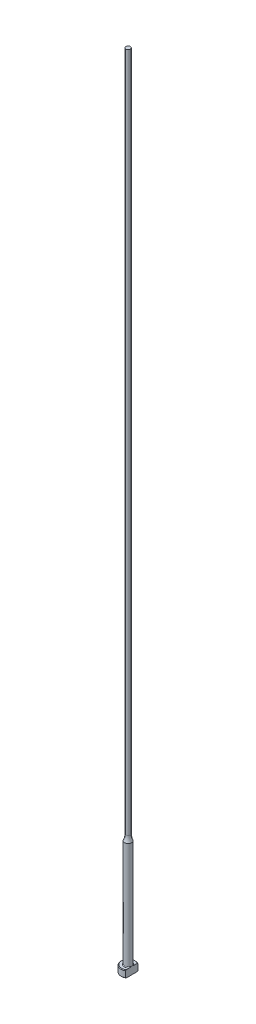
ISO-10303-21;
HEADER;
FILE_DESCRIPTION(('STEP AP214'),'2;1');
FILE_NAME('part.step','',(''),(''),'','','');
FILE_SCHEMA(('AUTOMOTIVE_DESIGN { 1 0 10303 214 1 1 1 1 }'));
ENDSEC;
DATA;
#1=APPLICATION_CONTEXT('core data for automotive mechanical design processes');
#2=APPLICATION_PROTOCOL_DEFINITION('international standard','automotive_design',2000,#1);
#3=PRODUCT_CONTEXT('',#1,'mechanical');
#4=PRODUCT('Part','Part','',(#3));
#5=PRODUCT_RELATED_PRODUCT_CATEGORY('part','',(#4));
#6=PRODUCT_DEFINITION_FORMATION('','',#4);
#7=PRODUCT_DEFINITION_CONTEXT('part definition',#1,'design');
#8=PRODUCT_DEFINITION('design','',#6,#7);
#9=PRODUCT_DEFINITION_SHAPE('','',#8);
#10=(LENGTH_UNIT() NAMED_UNIT(*) SI_UNIT(.MILLI.,.METRE.));
#11=(NAMED_UNIT(*) PLANE_ANGLE_UNIT() SI_UNIT($,.RADIAN.));
#12=(NAMED_UNIT(*) SI_UNIT($,.STERADIAN.) SOLID_ANGLE_UNIT());
#13=UNCERTAINTY_MEASURE_WITH_UNIT(LENGTH_MEASURE(1.E-05),#10,'distance_accuracy_value','');
#14=(GEOMETRIC_REPRESENTATION_CONTEXT(3) GLOBAL_UNCERTAINTY_ASSIGNED_CONTEXT((#13)) GLOBAL_UNIT_ASSIGNED_CONTEXT((#10,
#11,#12)) REPRESENTATION_CONTEXT('',''));
#15=CARTESIAN_POINT('',(0.,0.,0.));
#16=DIRECTION('',(0.,0.,1.));
#17=DIRECTION('',(1.,0.,0.));
#18=AXIS2_PLACEMENT_3D('',#15,#16,#17);
#19=CARTESIAN_POINT('',(-3.17499999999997,3.175,0.));
#20=DIRECTION('',(0.,1.,0.));
#21=DIRECTION('',(0.,0.,1.));
#22=AXIS2_PLACEMENT_3D('',#19,#20,#21);
#23=PLANE('',#22);
#24=CARTESIAN_POINT('',(0.,3.175,0.));
#25=DIRECTION('',(0.,1.,0.));
#26=DIRECTION('',(0.,0.,1.));
#27=AXIS2_PLACEMENT_3D('',#24,#25,#26);
#28=CIRCLE('',#27,2.92099999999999);
#29=CARTESIAN_POINT('',(1.58749999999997,3.175,-2.4519552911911));
#30=VERTEX_POINT('',#29);
#31=CARTESIAN_POINT('',(1.58749999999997,3.175,2.4519552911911));
#32=VERTEX_POINT('',#31);
#33=EDGE_CURVE('E105',#30,#32,#28,.T.);
#34=ORIENTED_EDGE('',*,*,#33,.T.);
#35=DIRECTION('',(0.,0.,1.));
#36=VECTOR('',#35,1.);
#37=CARTESIAN_POINT('',(1.58749999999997,3.17499999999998,2.74963065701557));
#38=LINE('',#37,#36);
#39=CARTESIAN_POINT('',(1.58749999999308,3.175,0.933255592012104));
#40=VERTEX_POINT('',#39);
#41=EDGE_CURVE('E126',#40,#32,#38,.T.);
#42=ORIENTED_EDGE('',*,*,#41,.F.);
#43=CARTESIAN_POINT('',(0.,3.175,0.));
#44=DIRECTION('',(0.,1.,0.));
#45=DIRECTION('',(0.,0.,1.));
#46=AXIS2_PLACEMENT_3D('',#43,#44,#45);
#47=CIRCLE('',#46,1.84149999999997);
#48=CARTESIAN_POINT('',(1.58749999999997,3.17500000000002,-0.933255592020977));
#49=VERTEX_POINT('',#48);
#50=EDGE_CURVE('E11',#40,#49,#47,.F.);
#51=ORIENTED_EDGE('',*,*,#50,.T.);
#52=EDGE_CURVE('E52',#30,#49,#38,.T.);
#53=ORIENTED_EDGE('',*,*,#52,.F.);
#54=EDGE_LOOP('',(#34,#42,#51,#53));
#55=FACE_BOUND('',#54,.T.);
#56=ADVANCED_FACE('F32',(#55),#23,.T.);
#57=CARTESIAN_POINT('',(0.,259.958771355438,0.));
#58=DIRECTION('',(0.,1.,0.));
#59=DIRECTION('',(0.,0.,1.));
#60=AXIS2_PLACEMENT_3D('',#57,#58,#59);
#61=CYLINDRICAL_SURFACE('',#60,3.17499999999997);
#62=CARTESIAN_POINT('',(0.,2.92100000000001,0.));
#63=DIRECTION('',(0.,1.,0.));
#64=DIRECTION('',(0.,0.,1.));
#65=AXIS2_PLACEMENT_3D('',#62,#63,#64);
#66=CIRCLE('',#65,3.17499999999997);
#67=CARTESIAN_POINT('',(1.58749999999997,2.92100000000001,2.74963065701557));
#68=VERTEX_POINT('',#67);
#69=CARTESIAN_POINT('',(1.58749999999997,2.92100000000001,-2.74963065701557));
#70=VERTEX_POINT('',#69);
#71=EDGE_CURVE('E98',#68,#70,#66,.F.);
#72=ORIENTED_EDGE('',*,*,#71,.T.);
#73=DIRECTION('',(0.,-1.,0.));
#74=VECTOR('',#73,1.);
#75=CARTESIAN_POINT('',(1.58749999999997,355.601,-2.74963065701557));
#76=LINE('',#75,#74);
#77=CARTESIAN_POINT('',(1.58749999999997,0.253999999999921,-2.74963065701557));
#78=VERTEX_POINT('',#77);
#79=EDGE_CURVE('E141',#70,#78,#76,.T.);
#80=ORIENTED_EDGE('',*,*,#79,.T.);
#81=CARTESIAN_POINT('',(0.,0.253999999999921,0.));
#82=DIRECTION('',(0.,-1.,0.));
#83=DIRECTION('',(0.,0.,-1.));
#84=AXIS2_PLACEMENT_3D('',#81,#82,#83);
#85=CIRCLE('',#84,3.17499999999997);
#86=CARTESIAN_POINT('',(1.58749999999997,0.253999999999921,2.74963065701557));
#87=VERTEX_POINT('',#86);
#88=EDGE_CURVE('E95',#78,#87,#85,.F.);
#89=ORIENTED_EDGE('',*,*,#88,.T.);
#90=DIRECTION('',(0.,-1.,0.));
#91=VECTOR('',#90,1.);
#92=CARTESIAN_POINT('',(1.58749999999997,355.601,2.74963065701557));
#93=LINE('',#92,#91);
#94=EDGE_CURVE('E88',#68,#87,#93,.T.);
#95=ORIENTED_EDGE('',*,*,#94,.F.);
#96=EDGE_LOOP('',(#72,#80,#89,#95));
#97=FACE_BOUND('',#96,.T.);
#98=ADVANCED_FACE('F191',(#97),#61,.T.);
#99=CARTESIAN_POINT('',(0.,0.,0.));
#100=DIRECTION('',(0.,-1.,0.));
#101=DIRECTION('',(0.,0.,-1.));
#102=AXIS2_PLACEMENT_3D('',#99,#100,#101);
#103=PLANE('',#102);
#104=CARTESIAN_POINT('',(0.,0.,0.));
#105=DIRECTION('',(0.,-1.,0.));
#106=DIRECTION('',(0.,0.,-1.));
#107=AXIS2_PLACEMENT_3D('',#104,#105,#106);
#108=CIRCLE('',#107,2.92100000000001);
#109=CARTESIAN_POINT('',(1.58749999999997,0.,2.45195529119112));
#110=VERTEX_POINT('',#109);
#111=CARTESIAN_POINT('',(1.58749999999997,0.,-2.45195529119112));
#112=VERTEX_POINT('',#111);
#113=EDGE_CURVE('E93',#110,#112,#108,.T.);
#114=ORIENTED_EDGE('',*,*,#113,.T.);
#115=DIRECTION('',(0.,0.,1.));
#116=VECTOR('',#115,1.);
#117=CARTESIAN_POINT('',(1.58749999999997,0.,2.74963065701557));
#118=LINE('',#117,#116);
#119=EDGE_CURVE('E78',#112,#110,#118,.T.);
#120=ORIENTED_EDGE('',*,*,#119,.T.);
#121=EDGE_LOOP('',(#114,#120));
#122=FACE_BOUND('',#121,.T.);
#123=ADVANCED_FACE('F97',(#122),#103,.T.);
#124=CARTESIAN_POINT('',(0.,3.17499999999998,0.));
#125=DIRECTION('',(0.,-1.,0.));
#126=DIRECTION('',(0.,0.,-1.));
#127=AXIS2_PLACEMENT_3D('',#124,#125,#126);
#128=CONICAL_SURFACE('',#127,2.92100000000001,0.785398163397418);
#129=ORIENTED_EDGE('',*,*,#71,.F.);
#130=CARTESIAN_POINT('',(1.58749999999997,-0.161620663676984,-6.0529050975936));
#131=CARTESIAN_POINT('',(1.58749999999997,-0.0288893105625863,-5.91567682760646));
#132=CARTESIAN_POINT('',(1.58749999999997,0.103699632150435,-5.77831035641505));
#133=CARTESIAN_POINT('',(1.58749999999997,0.368508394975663,-5.50321874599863));
#134=CARTESIAN_POINT('',(1.58749999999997,0.5007282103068,-5.3654936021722));
#135=CARTESIAN_POINT('',(1.58749999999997,0.764778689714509,-5.08953516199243));
#136=CARTESIAN_POINT('',(1.58749999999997,0.896609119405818,-4.95130164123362));
#137=CARTESIAN_POINT('',(1.58749999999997,1.15968706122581,-4.67428233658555));
#138=CARTESIAN_POINT('',(1.58749999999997,1.29093457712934,-4.5354965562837));
#139=CARTESIAN_POINT('',(1.58749999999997,1.55007705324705,-4.25997724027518));
#140=CARTESIAN_POINT('',(1.58749999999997,1.67798684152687,-4.12325766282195));
#141=CARTESIAN_POINT('',(1.58749999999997,1.9328486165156,-3.84892898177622));
#142=CARTESIAN_POINT('',(1.58749999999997,2.05980060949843,-3.71131988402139));
#143=CARTESIAN_POINT('',(1.58749999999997,2.31237508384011,-3.43493978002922));
#144=CARTESIAN_POINT('',(1.58749999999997,2.43799784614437,-3.29616903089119));
#145=CARTESIAN_POINT('',(1.58749999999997,2.68741369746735,-3.01699558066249));
#146=CARTESIAN_POINT('',(1.58749999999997,2.81120686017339,-2.8765929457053));
#147=CARTESIAN_POINT('',(1.58749999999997,3.00875865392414,-2.64816703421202));
#148=CARTESIAN_POINT('',(1.58749999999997,3.08336151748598,-2.56087478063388));
#149=CARTESIAN_POINT('',(1.58749999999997,3.23123871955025,-2.385154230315));
#150=CARTESIAN_POINT('',(1.58749999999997,3.30451292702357,-2.29672582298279));
#151=CARTESIAN_POINT('',(1.58749999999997,3.45004422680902,-2.11747400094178));
#152=CARTESIAN_POINT('',(1.58749999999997,3.52228237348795,-2.02663514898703));
#153=CARTESIAN_POINT('',(1.58749999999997,3.66423097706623,-1.84302524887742));
#154=CARTESIAN_POINT('',(1.58749999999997,3.73394203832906,-1.75025467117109));
#155=CARTESIAN_POINT('',(1.58749999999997,3.87080633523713,-1.56067475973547));
#156=CARTESIAN_POINT('',(1.58749999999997,3.93790459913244,-1.46382547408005));
#157=CARTESIAN_POINT('',(1.58749999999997,4.06669147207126,-1.26632594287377));
#158=CARTESIAN_POINT('',(1.58749999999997,4.12837264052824,-1.16567073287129));
#159=CARTESIAN_POINT('',(1.58749999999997,4.21402252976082,-1.01165766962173));
#160=CARTESIAN_POINT('',(1.58749999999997,4.2412792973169,-0.960142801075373));
#161=CARTESIAN_POINT('',(1.58749999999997,4.29309798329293,-0.85578092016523));
#162=CARTESIAN_POINT('',(1.58749999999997,4.3176594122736,-0.802933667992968));
#163=CARTESIAN_POINT('',(1.58749999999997,4.38614656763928,-0.642461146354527));
#164=CARTESIAN_POINT('',(1.58749999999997,4.42510149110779,-0.532518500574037));
#165=CARTESIAN_POINT('',(1.58749999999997,4.46726244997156,-0.367680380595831));
#166=CARTESIAN_POINT('',(1.58749999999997,4.47844427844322,-0.314802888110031));
#167=CARTESIAN_POINT('',(1.58749999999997,4.49576654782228,-0.208209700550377));
#168=CARTESIAN_POINT('',(1.58749999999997,4.50190743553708,-0.154494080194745));
#169=CARTESIAN_POINT('',(1.58749999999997,4.50871296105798,-0.0468792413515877));
#170=CARTESIAN_POINT('',(1.58749999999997,4.50939451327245,0.00701889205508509));
#171=CARTESIAN_POINT('',(1.58749999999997,4.5052767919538,0.114606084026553));
#172=CARTESIAN_POINT('',(1.58749999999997,4.5004770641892,0.16829512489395));
#173=CARTESIAN_POINT('',(1.58749999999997,4.48579689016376,0.274485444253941));
#174=CARTESIAN_POINT('',(1.58749999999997,4.47596081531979,0.326992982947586));
#175=CARTESIAN_POINT('',(1.58749999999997,4.4518180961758,0.430974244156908));
#176=CARTESIAN_POINT('',(1.58749999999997,4.43750969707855,0.482447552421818));
#177=CARTESIAN_POINT('',(1.58749999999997,4.40502489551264,0.58446088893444));
#178=CARTESIAN_POINT('',(1.58749999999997,4.38682724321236,0.634994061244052));
#179=CARTESIAN_POINT('',(1.58749999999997,4.34729308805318,0.734789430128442));
#180=CARTESIAN_POINT('',(1.58749999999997,4.32595722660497,0.784051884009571));
#181=CARTESIAN_POINT('',(1.58749999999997,4.25791922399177,0.93054934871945));
#182=CARTESIAN_POINT('',(1.58749999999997,4.20736047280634,1.02598802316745));
#183=CARTESIAN_POINT('',(1.58749999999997,4.09955451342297,1.21304313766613));
#184=CARTESIAN_POINT('',(1.58749999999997,4.04229912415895,1.30465471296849));
#185=CARTESIAN_POINT('',(1.58749999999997,3.92308746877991,1.48526211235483));
#186=CARTESIAN_POINT('',(1.58749999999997,3.86111349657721,1.57424615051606));
#187=CARTESIAN_POINT('',(1.58749999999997,3.73408621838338,1.74990003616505));
#188=CARTESIAN_POINT('',(1.58749999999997,3.66903444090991,1.83657099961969));
#189=CARTESIAN_POINT('',(1.58749999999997,3.53583371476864,2.009317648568));
#190=CARTESIAN_POINT('',(1.58749999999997,3.46765527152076,2.09537048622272));
#191=CARTESIAN_POINT('',(1.58749999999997,3.32960643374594,2.26611736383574));
#192=CARTESIAN_POINT('',(1.58749999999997,3.25973586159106,2.35081125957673));
#193=CARTESIAN_POINT('',(1.58749999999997,3.04858139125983,2.60290121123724));
#194=CARTESIAN_POINT('',(1.58749999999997,2.90542388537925,2.7687253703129));
#195=CARTESIAN_POINT('',(1.58749999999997,2.64069522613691,3.06970913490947));
#196=CARTESIAN_POINT('',(1.58749999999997,2.5195945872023,3.20528660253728));
#197=CARTESIAN_POINT('',(1.58749999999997,2.27590400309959,3.47510321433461));
#198=CARTESIAN_POINT('',(1.58749999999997,2.1533140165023,3.60934232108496));
#199=CARTESIAN_POINT('',(1.58749999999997,1.9069423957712,3.87695374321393));
#200=CARTESIAN_POINT('',(1.58749999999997,1.78315974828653,4.01032512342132));
#201=CARTESIAN_POINT('',(1.58749999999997,1.53478104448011,4.2763088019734));
#202=CARTESIAN_POINT('',(1.58749999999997,1.41018498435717,4.40892109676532));
#203=CARTESIAN_POINT('',(1.58749999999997,1.04574684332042,4.79499418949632));
#204=CARTESIAN_POINT('',(1.58749999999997,0.805076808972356,5.04767313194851));
#205=CARTESIAN_POINT('',(1.58749999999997,0.44312150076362,5.42550911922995));
#206=CARTESIAN_POINT('',(1.58749999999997,0.322378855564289,5.55118772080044));
#207=CARTESIAN_POINT('',(1.58749999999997,0.0805914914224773,5.8022520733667));
#208=CARTESIAN_POINT('',(1.58749999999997,-0.0404532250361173,5.92763782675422));
#209=CARTESIAN_POINT('',(1.58749999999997,-0.161620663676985,6.0529050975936));
#210=B_SPLINE_CURVE_WITH_KNOTS('',3,(#130,#131,#132,#133,#134,#135,#136,#137,#138,#139,#140,
#141,#142,#143,#144,#145,#146,#147,#148,#149,#150,#151,#152,#153,#154,#155,#156,#157,#158,#159,
#160,#161,#162,#163,#164,#165,#166,#167,#168,#169,#170,#171,#172,#173,#174,#175,#176,#177,#178,
#179,#180,#181,#182,#183,#184,#185,#186,#187,#188,#189,#190,#191,#192,#193,#194,#195,#196,#197,
#198,#199,#200,#201,#202,#203,#204,#205,#206,#207,#208,#209),.UNSPECIFIED.,.F.,.F.,(4,2,2,2,2,2,
2,2,2,2,2,2,2,2,2,2,2,2,2,2,2,2,2,2,2,2,2,2,2,2,2,2,2,2,2,2,2,2,2,4),(0.,0.572750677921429,
1.14550874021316,1.71856057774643,2.29160869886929,2.85328006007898,3.41494773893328,
3.97649423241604,4.53801804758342,4.88249307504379,5.2270018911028,5.57515326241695,
5.92322081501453,6.27657800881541,6.63041319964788,6.80518126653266,6.97998101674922,
7.32824262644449,7.49018491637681,7.65211285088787,7.81353889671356,7.97497832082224,
8.13501929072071,8.29512313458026,8.45612518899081,8.61709438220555,8.94062993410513,
9.26456495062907,9.58978187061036,9.91483894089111,10.2441741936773,10.5735441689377,
11.2306812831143,11.7760337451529,12.3214014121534,12.8672825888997,13.4131663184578,
14.4600164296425,14.9828595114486,15.505698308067),.UNSPECIFIED.);
#211=EDGE_CURVE('E118',#32,#68,#210,.T.);
#212=ORIENTED_EDGE('',*,*,#211,.F.);
#213=ORIENTED_EDGE('',*,*,#33,.F.);
#214=EDGE_CURVE('E117',#70,#30,#210,.T.);
#215=ORIENTED_EDGE('',*,*,#214,.F.);
#216=EDGE_LOOP('',(#129,#212,#213,#215));
#217=FACE_BOUND('',#216,.T.);
#218=ADVANCED_FACE('F162',(#217),#128,.T.);
#219=CARTESIAN_POINT('',(0.,0.253999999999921,0.));
#220=DIRECTION('',(0.,1.,0.));
#221=DIRECTION('',(0.,0.,1.));
#222=AXIS2_PLACEMENT_3D('',#219,#220,#221);
#223=CONICAL_SURFACE('',#222,3.17499999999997,0.785398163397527);
#224=ORIENTED_EDGE('',*,*,#88,.F.);
#225=CARTESIAN_POINT('',(1.58749999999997,3.33662066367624,6.0529050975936));
#226=CARTESIAN_POINT('',(1.58749999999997,3.20388931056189,5.91567682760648));
#227=CARTESIAN_POINT('',(1.58749999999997,3.07130036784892,5.7783103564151));
#228=CARTESIAN_POINT('',(1.58749999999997,2.80649160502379,5.50321874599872));
#229=CARTESIAN_POINT('',(1.58749999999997,2.6742717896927,5.36549360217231));
#230=CARTESIAN_POINT('',(1.58749999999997,2.41022131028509,5.08953516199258));
#231=CARTESIAN_POINT('',(1.58749999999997,2.27839088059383,4.95130164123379));
#232=CARTESIAN_POINT('',(1.58749999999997,2.01531293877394,4.67428233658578));
#233=CARTESIAN_POINT('',(1.58749999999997,1.88406542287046,4.53549655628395));
#234=CARTESIAN_POINT('',(1.58749999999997,1.62492294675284,4.25997724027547));
#235=CARTESIAN_POINT('',(1.58749999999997,1.49701315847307,4.12325766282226));
#236=CARTESIAN_POINT('',(1.58749999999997,1.24215138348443,3.84892898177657));
#237=CARTESIAN_POINT('',(1.58749999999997,1.11519939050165,3.71131988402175));
#238=CARTESIAN_POINT('',(1.58749999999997,0.862624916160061,3.43493978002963));
#239=CARTESIAN_POINT('',(1.58749999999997,0.737002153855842,3.29616903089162));
#240=CARTESIAN_POINT('',(1.58749999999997,0.487586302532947,3.01699558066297));
#241=CARTESIAN_POINT('',(1.58749999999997,0.363793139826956,2.8765929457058));
#242=CARTESIAN_POINT('',(1.58749999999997,0.166241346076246,2.64816703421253));
#243=CARTESIAN_POINT('',(1.58749999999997,0.0916384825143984,2.56087478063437));
#244=CARTESIAN_POINT('',(1.58749999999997,-0.0562387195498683,2.38515423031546));
#245=CARTESIAN_POINT('',(1.58749999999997,-0.129512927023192,2.29672582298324));
#246=CARTESIAN_POINT('',(1.58749999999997,-0.275044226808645,2.1174740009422));
#247=CARTESIAN_POINT('',(1.58749999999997,-0.347282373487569,2.02663514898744));
#248=CARTESIAN_POINT('',(1.58749999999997,-0.489230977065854,1.8430252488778));
#249=CARTESIAN_POINT('',(1.58749999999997,-0.558942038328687,1.75025467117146));
#250=CARTESIAN_POINT('',(1.58749999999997,-0.695806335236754,1.5606747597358));
#251=CARTESIAN_POINT('',(1.58749999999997,-0.762904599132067,1.46382547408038));
#252=CARTESIAN_POINT('',(1.58749999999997,-0.89169147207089,1.26632594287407));
#253=CARTESIAN_POINT('',(1.58749999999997,-0.953372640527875,1.16567073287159));
#254=CARTESIAN_POINT('',(1.58749999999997,-1.03902252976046,1.01165766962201));
#255=CARTESIAN_POINT('',(1.58749999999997,-1.06627929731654,0.960142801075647));
#256=CARTESIAN_POINT('',(1.58749999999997,-1.11809798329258,0.855780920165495));
#257=CARTESIAN_POINT('',(1.58749999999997,-1.14265941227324,0.802933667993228));
#258=CARTESIAN_POINT('',(1.58749999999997,-1.21114656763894,0.642461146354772));
#259=CARTESIAN_POINT('',(1.58749999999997,-1.25010149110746,0.532518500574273));
#260=CARTESIAN_POINT('',(1.58749999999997,-1.29226244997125,0.367680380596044));
#261=CARTESIAN_POINT('',(1.58749999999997,-1.30344427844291,0.314802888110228));
#262=CARTESIAN_POINT('',(1.58749999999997,-1.32076654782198,0.208209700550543));
#263=CARTESIAN_POINT('',(1.58749999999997,-1.32690743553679,0.154494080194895));
#264=CARTESIAN_POINT('',(1.58749999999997,-1.3337129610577,0.0468792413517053));
#265=CARTESIAN_POINT('',(1.58749999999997,-1.33439451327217,-0.00701889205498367));
#266=CARTESIAN_POINT('',(1.58749999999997,-1.33027679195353,-0.114606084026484));
#267=CARTESIAN_POINT('',(1.58749999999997,-1.32547706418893,-0.168295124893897));
#268=CARTESIAN_POINT('',(1.58749999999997,-1.31079689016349,-0.274485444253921));
#269=CARTESIAN_POINT('',(1.58749999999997,-1.30096081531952,-0.326992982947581));
#270=CARTESIAN_POINT('',(1.58749999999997,-1.27681809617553,-0.430974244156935));
#271=CARTESIAN_POINT('',(1.58749999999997,-1.26250969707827,-0.48244755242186));
#272=CARTESIAN_POINT('',(1.58749999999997,-1.23002489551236,-0.584460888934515));
#273=CARTESIAN_POINT('',(1.58749999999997,-1.21182724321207,-0.634994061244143));
#274=CARTESIAN_POINT('',(1.58749999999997,-1.17229308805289,-0.734789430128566));
#275=CARTESIAN_POINT('',(1.58749999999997,-1.15095722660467,-0.784051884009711));
#276=CARTESIAN_POINT('',(1.58749999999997,-1.08291922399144,-0.930549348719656));
#277=CARTESIAN_POINT('',(1.58749999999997,-1.03236047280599,-1.0259880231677));
#278=CARTESIAN_POINT('',(1.58749999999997,-0.924554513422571,-1.21304313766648));
#279=CARTESIAN_POINT('',(1.58749999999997,-0.867299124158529,-1.30465471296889));
#280=CARTESIAN_POINT('',(1.58749999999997,-0.748087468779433,-1.48526211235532));
#281=CARTESIAN_POINT('',(1.58749999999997,-0.686113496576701,-1.5742461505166));
#282=CARTESIAN_POINT('',(1.58749999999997,-0.559086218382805,-1.74990003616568));
#283=CARTESIAN_POINT('',(1.58749999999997,-0.494034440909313,-1.83657099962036));
#284=CARTESIAN_POINT('',(1.58749999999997,-0.360833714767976,-2.00931764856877));
#285=CARTESIAN_POINT('',(1.58749999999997,-0.292655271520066,-2.09537048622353));
#286=CARTESIAN_POINT('',(1.58749999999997,-0.154606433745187,-2.26611736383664));
#287=CARTESIAN_POINT('',(1.58749999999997,-0.0847358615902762,-2.35081125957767));
#288=CARTESIAN_POINT('',(1.58749999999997,0.126418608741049,-2.60290121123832));
#289=CARTESIAN_POINT('',(1.58749999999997,0.269576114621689,-2.76872537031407));
#290=CARTESIAN_POINT('',(1.58749999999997,0.534304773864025,-3.06970913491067));
#291=CARTESIAN_POINT('',(1.58749999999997,0.655405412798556,-3.20528660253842));
#292=CARTESIAN_POINT('',(1.58749999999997,0.899095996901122,-3.47510321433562));
#293=CARTESIAN_POINT('',(1.58749999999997,1.02168598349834,-3.60934232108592));
#294=CARTESIAN_POINT('',(1.58749999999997,1.26805760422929,-3.87695374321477));
#295=CARTESIAN_POINT('',(1.58749999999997,1.39184025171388,-4.0103251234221));
#296=CARTESIAN_POINT('',(1.58749999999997,1.64021895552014,-4.27630880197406));
#297=CARTESIAN_POINT('',(1.58749999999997,1.76481501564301,-4.40892109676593));
#298=CARTESIAN_POINT('',(1.58749999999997,2.12925315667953,-4.79499418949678));
#299=CARTESIAN_POINT('',(1.58749999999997,2.36992319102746,-5.04767313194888));
#300=CARTESIAN_POINT('',(1.58749999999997,2.73187849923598,-5.42550911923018));
#301=CARTESIAN_POINT('',(1.58749999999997,2.85262114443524,-5.55118772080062));
#302=CARTESIAN_POINT('',(1.58749999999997,3.09440850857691,-5.80225207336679));
#303=CARTESIAN_POINT('',(1.58749999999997,3.21545322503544,-5.92763782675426));
#304=CARTESIAN_POINT('',(1.58749999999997,3.33662066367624,-6.0529050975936));
#305=B_SPLINE_CURVE_WITH_KNOTS('',3,(#225,#226,#227,#228,#229,#230,#231,#232,#233,#234,#235,
#236,#237,#238,#239,#240,#241,#242,#243,#244,#245,#246,#247,#248,#249,#250,#251,#252,#253,#254,
#255,#256,#257,#258,#259,#260,#261,#262,#263,#264,#265,#266,#267,#268,#269,#270,#271,#272,#273,
#274,#275,#276,#277,#278,#279,#280,#281,#282,#283,#284,#285,#286,#287,#288,#289,#290,#291,#292,
#293,#294,#295,#296,#297,#298,#299,#300,#301,#302,#303,#304),.UNSPECIFIED.,.F.,.F.,(4,2,2,2,2,2,
2,2,2,2,2,2,2,2,2,2,2,2,2,2,2,2,2,2,2,2,2,2,2,2,2,2,2,2,2,2,2,2,2,4),(0.,0.572750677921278,
1.14550874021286,1.71856057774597,2.29160869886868,2.85328006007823,3.4149477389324,
3.97649423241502,4.53801804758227,4.88249307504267,5.22700189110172,5.5751532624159,
5.92322081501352,6.27657800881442,6.63041319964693,6.80518126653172,6.9799810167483,
7.3282426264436,7.49018491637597,7.65211285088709,7.81353889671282,7.97497832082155,
8.13501929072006,8.29512313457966,8.45612518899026,8.61709438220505,8.9406299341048,
9.2645649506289,9.58978187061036,9.91483894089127,10.2441741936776,10.5735441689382,
11.2306812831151,11.7760337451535,12.3214014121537,12.8672825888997,13.4131663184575,
14.4600164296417,14.9828595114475,15.5056983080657),.UNSPECIFIED.);
#306=EDGE_CURVE('E81',#112,#78,#305,.T.);
#307=ORIENTED_EDGE('',*,*,#306,.F.);
#308=ORIENTED_EDGE('',*,*,#113,.F.);
#309=EDGE_CURVE('E84',#87,#110,#305,.T.);
#310=ORIENTED_EDGE('',*,*,#309,.F.);
#311=EDGE_LOOP('',(#224,#307,#308,#310));
#312=FACE_BOUND('',#311,.T.);
#313=ADVANCED_FACE('F92',(#312),#223,.T.);
#314=CARTESIAN_POINT('',(0.,3.42900000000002,0.));
#315=DIRECTION('',(0.,1.,0.));
#316=DIRECTION('',(0.,0.,1.));
#317=AXIS2_PLACEMENT_3D('',#314,#315,#316);
#318=TOROIDAL_SURFACE('',#317,1.84149999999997,0.254);
#319=CARTESIAN_POINT('',(1.58749999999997,3.42900000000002,0.));
#320=CARTESIAN_POINT('',(1.58749999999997,3.42899942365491,-1.9220514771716E-10));
#321=CARTESIAN_POINT('',(1.58749999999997,3.42899884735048,-1.2261161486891E-07));
#322=CARTESIAN_POINT('',(1.58749999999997,3.42899773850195,-5.09676365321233E-07));
#323=CARTESIAN_POINT('',(1.58749999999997,3.42899720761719,-7.78176328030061E-07));
#324=CARTESIAN_POINT('',(1.58749999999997,3.42899614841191,-1.42307272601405E-06));
#325=CARTESIAN_POINT('',(1.58749999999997,3.42899562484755,-1.80713867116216E-06));
#326=CARTESIAN_POINT('',(1.58749999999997,3.42899463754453,-2.63494846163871E-06));
#327=CARTESIAN_POINT('',(1.58749999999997,3.42899417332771,-3.07814756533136E-06));
#328=CARTESIAN_POINT('',(1.58749999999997,3.42899261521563,-4.66897357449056E-06));
#329=CARTESIAN_POINT('',(1.58749999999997,3.42899159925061,-5.89404908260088E-06));
#330=CARTESIAN_POINT('',(1.58749999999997,3.42898979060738,-8.42427511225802E-06));
#331=CARTESIAN_POINT('',(1.58749999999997,3.42898899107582,-9.7248057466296E-06));
#332=CARTESIAN_POINT('',(1.58749999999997,3.42898598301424,-1.48060601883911E-05));
#333=CARTESIAN_POINT('',(1.58749999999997,3.42898393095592,-1.86838281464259E-05));
#334=CARTESIAN_POINT('',(1.58749999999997,3.42898057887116,-2.63261117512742E-05));
#335=CARTESIAN_POINT('',(1.58749999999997,3.42897922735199,-3.00687417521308E-05));
#336=CARTESIAN_POINT('',(1.58749999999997,3.42897347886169,-4.60276298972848E-05));
#337=CARTESIAN_POINT('',(1.58749999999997,3.42896911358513,-5.8247019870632E-05));
#338=CARTESIAN_POINT('',(1.58749999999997,3.42896211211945,-8.11070097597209E-05));
#339=CARTESIAN_POINT('',(1.58749999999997,3.42895931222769,-9.16953114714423E-05));
#340=CARTESIAN_POINT('',(1.58749999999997,3.42893712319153,-0.000168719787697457));
#341=CARTESIAN_POINT('',(1.58749999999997,3.42890881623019,-0.000232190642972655));
#342=CARTESIAN_POINT('',(1.58749999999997,3.42880276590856,-0.000479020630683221));
#343=CARTESIAN_POINT('',(1.58749999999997,3.42873165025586,-0.00066443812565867));
#344=CARTESIAN_POINT('',(1.58749999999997,3.42845137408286,-0.0013844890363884));
#345=CARTESIAN_POINT('',(1.58749999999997,3.42823526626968,-0.00191701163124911));
#346=CARTESIAN_POINT('',(1.58749999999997,3.42735449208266,-0.00409774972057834));
#347=CARTESIAN_POINT('',(1.58749999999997,3.42669768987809,-0.00574830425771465));
#348=CARTESIAN_POINT('',(1.58749999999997,3.4174405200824,-0.0289985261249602));
#349=CARTESIAN_POINT('',(1.58749999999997,3.40878325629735,-0.0505816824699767));
#350=CARTESIAN_POINT('',(1.58749999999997,3.39189297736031,-0.0929947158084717));
#351=CARTESIAN_POINT('',(1.58749999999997,3.38365605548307,-0.11382315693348));
#352=CARTESIAN_POINT('',(1.58749999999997,3.36635393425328,-0.157956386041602));
#353=CARTESIAN_POINT('',(1.58749999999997,3.35730391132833,-0.181267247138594));
#354=CARTESIAN_POINT('',(1.58749999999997,3.33936775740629,-0.228222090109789));
#355=CARTESIAN_POINT('',(1.58749999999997,3.33048420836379,-0.25186705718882));
#356=CARTESIAN_POINT('',(1.58749999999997,3.30894496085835,-0.310512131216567));
#357=CARTESIAN_POINT('',(1.58749999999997,3.29649449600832,-0.345588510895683));
#358=CARTESIAN_POINT('',(1.58749999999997,3.27296975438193,-0.415278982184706));
#359=CARTESIAN_POINT('',(1.58749999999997,3.26186987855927,-0.449884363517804));
#360=CARTESIAN_POINT('',(1.58749999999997,3.2395832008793,-0.524471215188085));
#361=CARTESIAN_POINT('',(1.58749999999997,3.22860862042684,-0.564517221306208));
#362=CARTESIAN_POINT('',(1.58749999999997,3.20902534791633,-0.645529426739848));
#363=CARTESIAN_POINT('',(1.58749999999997,3.20043582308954,-0.686500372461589));
#364=CARTESIAN_POINT('',(1.58749999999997,3.18611712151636,-0.771546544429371));
#365=CARTESIAN_POINT('',(1.58749999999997,3.18059550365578,-0.815658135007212));
#366=CARTESIAN_POINT('',(1.58749999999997,3.17455396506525,-0.904117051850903));
#367=CARTESIAN_POINT('',(1.58749999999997,3.17401361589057,-0.948462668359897));
#368=CARTESIAN_POINT('',(1.58749999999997,3.17898948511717,-1.02531896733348));
#369=CARTESIAN_POINT('',(1.58749999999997,3.1829739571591,-1.05792141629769));
#370=CARTESIAN_POINT('',(1.58749999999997,3.19569167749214,-1.12184393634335));
#371=CARTESIAN_POINT('',(1.58749999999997,3.20436049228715,-1.1531753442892));
#372=CARTESIAN_POINT('',(1.58749999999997,3.22236152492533,-1.19946468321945));
#373=CARTESIAN_POINT('',(1.58749999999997,3.2295150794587,-1.21526783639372));
#374=CARTESIAN_POINT('',(1.58749999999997,3.24587062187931,-1.24583726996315));
#375=CARTESIAN_POINT('',(1.58749999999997,3.25507530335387,-1.26060215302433));
#376=CARTESIAN_POINT('',(1.58749999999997,3.27378481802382,-1.28575815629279));
#377=CARTESIAN_POINT('',(1.58749999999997,3.28289001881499,-1.29644383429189));
#378=CARTESIAN_POINT('',(1.58749999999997,3.30268460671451,-1.31623154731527));
#379=CARTESIAN_POINT('',(1.58749999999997,3.31337067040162,-1.32533681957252));
#380=CARTESIAN_POINT('',(1.58749999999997,3.33349977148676,-1.33941140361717));
#381=CARTESIAN_POINT('',(1.58749999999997,3.34261446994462,-1.34484814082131));
#382=CARTESIAN_POINT('',(1.58749999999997,3.36161455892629,-1.35416329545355));
#383=CARTESIAN_POINT('',(1.58749999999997,3.37149946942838,-1.35804267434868));
#384=CARTESIAN_POINT('',(1.58749999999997,3.39188678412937,-1.36398436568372));
#385=CARTESIAN_POINT('',(1.58749999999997,3.40239309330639,-1.36603350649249));
#386=CARTESIAN_POINT('',(1.58749999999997,3.42360372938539,-1.3680840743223));
#387=CARTESIAN_POINT('',(1.58749999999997,3.43430795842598,-1.36808648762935));
#388=CARTESIAN_POINT('',(1.58749999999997,3.45433283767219,-1.36616208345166));
#389=CARTESIAN_POINT('',(1.58749999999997,3.46367506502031,-1.36444960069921));
#390=CARTESIAN_POINT('',(1.58749999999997,3.48195519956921,-1.35953338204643));
#391=CARTESIAN_POINT('',(1.58749999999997,3.49089304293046,-1.3563294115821));
#392=CARTESIAN_POINT('',(1.58749999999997,3.50850302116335,-1.34848006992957));
#393=CARTESIAN_POINT('',(1.58749999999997,3.5171531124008,-1.34378578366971));
#394=CARTESIAN_POINT('',(1.58749999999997,3.53371257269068,-1.33324445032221));
#395=CARTESIAN_POINT('',(1.58749999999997,3.54162163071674,-1.32739692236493));
#396=CARTESIAN_POINT('',(1.58749999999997,3.56107121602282,-1.31107304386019));
#397=CARTESIAN_POINT('',(1.58749999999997,3.57202221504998,-1.29989286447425));
#398=CARTESIAN_POINT('',(1.58749999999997,3.59202509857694,-1.27593566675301));
#399=CARTESIAN_POINT('',(1.58749999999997,3.60107086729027,-1.26315370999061));
#400=CARTESIAN_POINT('',(1.58749999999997,3.62186023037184,-1.22930733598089));
#401=CARTESIAN_POINT('',(1.58749999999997,3.63240584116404,-1.20751096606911));
#402=CARTESIAN_POINT('',(1.58749999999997,3.65004643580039,-1.16266144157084));
#403=CARTESIAN_POINT('',(1.58749999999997,3.65714435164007,-1.13960937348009));
#404=CARTESIAN_POINT('',(1.58749999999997,3.67265428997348,-1.07603916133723));
#405=CARTESIAN_POINT('',(1.58749999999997,3.67834921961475,-1.03486686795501));
#406=CARTESIAN_POINT('',(1.58749999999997,3.68382880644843,-0.951558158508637));
#407=CARTESIAN_POINT('',(1.58749999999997,3.68350976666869,-0.909417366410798));
#408=CARTESIAN_POINT('',(1.58749999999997,3.67745397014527,-0.811383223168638));
#409=CARTESIAN_POINT('',(1.58749999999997,3.66993873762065,-0.755610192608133));
#410=CARTESIAN_POINT('',(1.58749999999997,3.64933373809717,-0.644937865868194));
#411=CARTESIAN_POINT('',(1.58749999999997,3.63621897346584,-0.59004364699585));
#412=CARTESIAN_POINT('',(1.58749999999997,3.60740922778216,-0.485757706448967));
#413=CARTESIAN_POINT('',(1.58749999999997,3.59201096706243,-0.436281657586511));
#414=CARTESIAN_POINT('',(1.58749999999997,3.55922497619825,-0.338551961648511));
#415=CARTESIAN_POINT('',(1.58749999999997,3.5418584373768,-0.290291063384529));
#416=CARTESIAN_POINT('',(1.58749999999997,3.51760237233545,-0.225557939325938));
#417=CARTESIAN_POINT('',(1.58749999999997,3.51126413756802,-0.208874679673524));
#418=CARTESIAN_POINT('',(1.58749999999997,3.49830042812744,-0.17512392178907));
#419=CARTESIAN_POINT('',(1.58749999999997,3.49167176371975,-0.158057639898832));
#420=CARTESIAN_POINT('',(1.58749999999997,3.47585523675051,-0.117638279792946));
#421=CARTESIAN_POINT('',(1.58749999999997,3.46662970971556,-0.0943002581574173));
#422=CARTESIAN_POINT('',(1.58749999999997,3.44889695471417,-0.0497824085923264));
#423=CARTESIAN_POINT('',(1.58749999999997,3.44040039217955,-0.028598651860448));
#424=CARTESIAN_POINT('',(1.58749999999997,3.43130364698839,-0.00575168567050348));
#425=CARTESIAN_POINT('',(1.58749999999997,3.43064818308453,-0.00410451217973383));
#426=CARTESIAN_POINT('',(1.58749999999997,3.42976776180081,-0.00192459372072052));
#427=CARTESIAN_POINT('',(1.58749999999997,3.42955062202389,-0.00138952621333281));
#428=CARTESIAN_POINT('',(1.58749999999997,3.42926908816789,-0.000666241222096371));
#429=CARTESIAN_POINT('',(1.58749999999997,3.42919771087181,-0.000480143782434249));
#430=CARTESIAN_POINT('',(1.58749999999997,3.42909131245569,-0.000232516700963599));
#431=CARTESIAN_POINT('',(1.58749999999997,3.42906294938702,-0.000168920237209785));
#432=CARTESIAN_POINT('',(1.58749999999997,3.42904072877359,-9.17527162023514E-05));
#433=CARTESIAN_POINT('',(1.58749999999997,3.42903792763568,-8.11550293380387E-05));
#434=CARTESIAN_POINT('',(1.58749999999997,3.42903091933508,-5.82743948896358E-05));
#435=CARTESIAN_POINT('',(1.58749999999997,3.42902654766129,-4.60440001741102E-05));
#436=CARTESIAN_POINT('',(1.58749999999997,3.42902079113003,-3.00727682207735E-05));
#437=CARTESIAN_POINT('',(1.58749999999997,3.42901943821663,-2.63286807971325E-05));
#438=CARTESIAN_POINT('',(1.58749999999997,3.42901608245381,-1.86836529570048E-05));
#439=CARTESIAN_POINT('',(1.58749999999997,3.4290140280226,-1.48046517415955E-05));
#440=CARTESIAN_POINT('',(1.58749999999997,3.42901101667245,-9.72223943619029E-06));
#441=CARTESIAN_POINT('',(1.58749999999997,3.42901021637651,-8.42159649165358E-06));
#442=CARTESIAN_POINT('',(1.58749999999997,3.42900840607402,-5.89129729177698E-06));
#443=CARTESIAN_POINT('',(1.58749999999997,3.42900738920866,-4.66626867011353E-06));
#444=CARTESIAN_POINT('',(1.58749999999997,3.42900582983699,-3.07568803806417E-06));
#445=CARTESIAN_POINT('',(1.58749999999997,3.42900536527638,-2.63259565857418E-06));
#446=CARTESIAN_POINT('',(1.58749999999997,3.4290043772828,-1.80506085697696E-06));
#447=CARTESIAN_POINT('',(1.58749999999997,3.42900385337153,-1.42116387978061E-06));
#448=CARTESIAN_POINT('',(1.58749999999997,3.42900279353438,-7.76675643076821E-07));
#449=CARTESIAN_POINT('',(1.58749999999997,3.42900226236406,-5.08406487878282E-07));
#450=CARTESIAN_POINT('',(1.58749999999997,3.42900115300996,-1.21901887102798E-07));
#451=CARTESIAN_POINT('',(1.58749999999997,3.42900057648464,1.92251677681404E-10));
#452=CARTESIAN_POINT('',(1.58749999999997,3.42900000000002,0.));
#453=B_SPLINE_CURVE_WITH_KNOTS('',3,(#319,#320,#321,#322,#323,#324,#325,#326,#327,#328,#329,
#330,#331,#332,#333,#334,#335,#336,#337,#338,#339,#340,#341,#342,#343,#344,#345,#346,#347,#348,
#349,#350,#351,#352,#353,#354,#355,#356,#357,#358,#359,#360,#361,#362,#363,#364,#365,#366,#367,
#368,#369,#370,#371,#372,#373,#374,#375,#376,#377,#378,#379,#380,#381,#382,#383,#384,#385,#386,
#387,#388,#389,#390,#391,#392,#393,#394,#395,#396,#397,#398,#399,#400,#401,#402,#403,#404,#405,
#406,#407,#408,#409,#410,#411,#412,#413,#414,#415,#416,#417,#418,#419,#420,#421,#422,#423,#424,
#425,#426,#427,#428,#429,#430,#431,#432,#433,#434,#435,#436,#437,#438,#439,#440,#441,#442,#443,
#444,#445,#446,#447,#448,#449,#450,#451,#452),.UNSPECIFIED.,.T.,.F.,(4,2,2,2,2,2,2,2,2,2,2,2,2,
2,2,2,2,2,2,2,2,2,2,2,2,2,2,2,2,2,2,2,2,2,2,2,2,2,2,2,2,2,2,2,2,2,2,2,2,2,2,2,2,2,2,2,2,2,2,2,2,
2,2,2,2,2,4),(0.,1.72815458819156E-06,3.50429255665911E-06,5.44431004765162E-06,
7.3675525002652E-06,1.2119089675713E-05,1.66953775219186E-05,2.98160400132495E-05,
4.17409564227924E-05,8.0660475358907E-05,0.000113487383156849,0.000321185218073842,
0.000917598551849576,0.00264089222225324,0.00797105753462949,0.0777276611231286,
0.144923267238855,0.219939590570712,0.295714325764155,0.407362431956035,0.516367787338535,
0.640878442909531,0.766362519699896,0.899536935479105,1.03216495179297,1.13045740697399,
1.22743103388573,1.27935899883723,1.33135556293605,1.37333248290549,1.41522237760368,
1.44693946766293,1.47863694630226,1.51056074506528,1.54246916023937,1.57083210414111,
1.59919951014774,1.62861579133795,1.65804436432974,1.70472658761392,1.75155645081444,
1.82378709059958,1.89595619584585,2.01995471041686,2.1460932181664,2.31447224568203,
2.48361094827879,2.6389891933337,2.79283011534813,2.84637031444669,2.9012946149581,
2.97658236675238,3.04504771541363,3.05036697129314,3.05209849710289,3.05269709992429,
3.05290520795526,3.05293806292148,3.05297701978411,3.05298895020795,3.05300207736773,
3.05300665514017,3.0530114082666,3.05301333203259,3.05301527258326,3.05301704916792,
3.05301877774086),.UNSPECIFIED.);
#454=CARTESIAN_POINT('',(1.58749999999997,3.42900000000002,0.));
#455=VERTEX_POINT('',#454);
#456=EDGE_CURVE('E47',#455,#49,#453,.T.);
#457=ORIENTED_EDGE('',*,*,#456,.T.);
#458=ORIENTED_EDGE('',*,*,#50,.F.);
#459=CARTESIAN_POINT('',(1.58749999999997,3.42900000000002,0.));
#460=CARTESIAN_POINT('',(1.58749999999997,3.42900057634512,1.9220512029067E-10));
#461=CARTESIAN_POINT('',(1.58749999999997,3.42900115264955,1.22611614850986E-07));
#462=CARTESIAN_POINT('',(1.58749999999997,3.42900226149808,5.09676365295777E-07));
#463=CARTESIAN_POINT('',(1.58749999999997,3.42900279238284,7.78176328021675E-07));
#464=CARTESIAN_POINT('',(1.58749999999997,3.42900385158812,1.42307272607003E-06));
#465=CARTESIAN_POINT('',(1.58749999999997,3.42900437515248,1.80713867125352E-06));
#466=CARTESIAN_POINT('',(1.58749999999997,3.4290053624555,2.63494846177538E-06));
#467=CARTESIAN_POINT('',(1.58749999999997,3.42900582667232,3.0781475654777E-06));
#468=CARTESIAN_POINT('',(1.58749999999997,3.4290073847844,4.66897357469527E-06));
#469=CARTESIAN_POINT('',(1.58749999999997,3.42900840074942,5.89404908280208E-06));
#470=CARTESIAN_POINT('',(1.58749999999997,3.42901020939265,8.42427511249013E-06));
#471=CARTESIAN_POINT('',(1.58749999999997,3.42901100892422,9.72480574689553E-06));
#472=CARTESIAN_POINT('',(1.58749999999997,3.42901401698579,1.48060601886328E-05));
#473=CARTESIAN_POINT('',(1.58749999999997,3.42901606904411,1.86838281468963E-05));
#474=CARTESIAN_POINT('',(1.58749999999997,3.42901942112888,2.63261117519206E-05));
#475=CARTESIAN_POINT('',(1.58749999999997,3.42902077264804,3.00687417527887E-05));
#476=CARTESIAN_POINT('',(1.58749999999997,3.42902652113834,4.60276298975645E-05));
#477=CARTESIAN_POINT('',(1.58749999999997,3.4290308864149,5.82470198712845E-05));
#478=CARTESIAN_POINT('',(1.58749999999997,3.42903788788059,8.11070097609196E-05));
#479=CARTESIAN_POINT('',(1.58749999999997,3.42904068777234,9.16953114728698E-05));
#480=CARTESIAN_POINT('',(1.58749999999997,3.4290628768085,0.000168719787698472));
#481=CARTESIAN_POINT('',(1.58749999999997,3.42909118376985,0.000232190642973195));
#482=CARTESIAN_POINT('',(1.58749999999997,3.42919723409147,0.000479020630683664));
#483=CARTESIAN_POINT('',(1.58749999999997,3.42926834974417,0.000664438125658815));
#484=CARTESIAN_POINT('',(1.58749999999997,3.42954862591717,0.00138448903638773));
#485=CARTESIAN_POINT('',(1.58749999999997,3.42976473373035,0.00191701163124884));
#486=CARTESIAN_POINT('',(1.58749999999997,3.43064550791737,0.00409774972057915));
#487=CARTESIAN_POINT('',(1.58749999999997,3.43130231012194,0.00574830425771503));
#488=CARTESIAN_POINT('',(1.58749999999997,3.44055947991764,0.0289985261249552));
#489=CARTESIAN_POINT('',(1.58749999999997,3.44921674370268,0.0505816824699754));
#490=CARTESIAN_POINT('',(1.58749999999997,3.46610702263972,0.0929947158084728));
#491=CARTESIAN_POINT('',(1.58749999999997,3.47434394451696,0.11382315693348));
#492=CARTESIAN_POINT('',(1.58749999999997,3.49164606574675,0.157956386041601));
#493=CARTESIAN_POINT('',(1.58749999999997,3.5006960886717,0.181267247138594));
#494=CARTESIAN_POINT('',(1.58749999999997,3.51863224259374,0.228222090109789));
#495=CARTESIAN_POINT('',(1.58749999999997,3.52751579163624,0.25186705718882));
#496=CARTESIAN_POINT('',(1.58749999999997,3.54905503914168,0.310512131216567));
#497=CARTESIAN_POINT('',(1.58749999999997,3.56150550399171,0.345588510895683));
#498=CARTESIAN_POINT('',(1.58749999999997,3.5850302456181,0.415278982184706));
#499=CARTESIAN_POINT('',(1.58749999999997,3.59613012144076,0.449884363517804));
#500=CARTESIAN_POINT('',(1.58749999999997,3.61841679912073,0.524471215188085));
#501=CARTESIAN_POINT('',(1.58749999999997,3.62939137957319,0.564517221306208));
#502=CARTESIAN_POINT('',(1.58749999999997,3.6489746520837,0.645529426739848));
#503=CARTESIAN_POINT('',(1.58749999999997,3.65756417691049,0.686500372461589));
#504=CARTESIAN_POINT('',(1.58749999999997,3.67188287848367,0.771546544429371));
#505=CARTESIAN_POINT('',(1.58749999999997,3.67740449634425,0.815658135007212));
#506=CARTESIAN_POINT('',(1.58749999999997,3.68344603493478,0.904117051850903));
#507=CARTESIAN_POINT('',(1.58749999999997,3.68398638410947,0.948462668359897));
#508=CARTESIAN_POINT('',(1.58749999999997,3.67901051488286,1.02531896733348));
#509=CARTESIAN_POINT('',(1.58749999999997,3.67502604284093,1.05792141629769));
#510=CARTESIAN_POINT('',(1.58749999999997,3.66230832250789,1.12184393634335));
#511=CARTESIAN_POINT('',(1.58749999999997,3.65363950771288,1.1531753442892));
#512=CARTESIAN_POINT('',(1.58749999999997,3.6356384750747,1.19946468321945));
#513=CARTESIAN_POINT('',(1.58749999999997,3.62848492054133,1.21526783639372));
#514=CARTESIAN_POINT('',(1.58749999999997,3.61212937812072,1.24583726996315));
#515=CARTESIAN_POINT('',(1.58749999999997,3.60292469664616,1.26060215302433));
#516=CARTESIAN_POINT('',(1.58749999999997,3.58421518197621,1.28575815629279));
#517=CARTESIAN_POINT('',(1.58749999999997,3.57510998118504,1.29644383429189));
#518=CARTESIAN_POINT('',(1.58749999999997,3.55531539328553,1.31623154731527));
#519=CARTESIAN_POINT('',(1.58749999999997,3.54462932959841,1.32533681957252));
#520=CARTESIAN_POINT('',(1.58749999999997,3.52450022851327,1.33941140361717));
#521=CARTESIAN_POINT('',(1.58749999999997,3.51538553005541,1.34484814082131));
#522=CARTESIAN_POINT('',(1.58749999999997,3.49638544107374,1.35416329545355));
#523=CARTESIAN_POINT('',(1.58749999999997,3.48650053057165,1.35804267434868));
#524=CARTESIAN_POINT('',(1.58749999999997,3.46611321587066,1.36398436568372));
#525=CARTESIAN_POINT('',(1.58749999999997,3.45560690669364,1.36603350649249));
#526=CARTESIAN_POINT('',(1.58749999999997,3.43439627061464,1.3680840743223));
#527=CARTESIAN_POINT('',(1.58749999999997,3.42369204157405,1.36808648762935));
#528=CARTESIAN_POINT('',(1.58749999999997,3.40366716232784,1.36616208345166));
#529=CARTESIAN_POINT('',(1.58749999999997,3.39432493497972,1.36444960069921));
#530=CARTESIAN_POINT('',(1.58749999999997,3.37604480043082,1.35953338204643));
#531=CARTESIAN_POINT('',(1.58749999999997,3.36710695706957,1.3563294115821));
#532=CARTESIAN_POINT('',(1.58749999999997,3.34949697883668,1.34848006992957));
#533=CARTESIAN_POINT('',(1.58749999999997,3.34084688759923,1.34378578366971));
#534=CARTESIAN_POINT('',(1.58749999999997,3.32428742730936,1.33324445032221));
#535=CARTESIAN_POINT('',(1.58749999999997,3.31637836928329,1.32739692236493));
#536=CARTESIAN_POINT('',(1.58749999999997,3.29692878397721,1.31107304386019));
#537=CARTESIAN_POINT('',(1.58749999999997,3.28597778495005,1.29989286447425));
#538=CARTESIAN_POINT('',(1.58749999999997,3.26597490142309,1.27593566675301));
#539=CARTESIAN_POINT('',(1.58749999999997,3.25692913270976,1.26315370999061));
#540=CARTESIAN_POINT('',(1.58749999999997,3.23613976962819,1.22930733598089));
#541=CARTESIAN_POINT('',(1.58749999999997,3.22559415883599,1.20751096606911));
#542=CARTESIAN_POINT('',(1.58749999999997,3.20795356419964,1.16266144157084));
#543=CARTESIAN_POINT('',(1.58749999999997,3.20085564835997,1.13960937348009));
#544=CARTESIAN_POINT('',(1.58749999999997,3.18534571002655,1.07603916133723));
#545=CARTESIAN_POINT('',(1.58749999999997,3.17965078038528,1.03486686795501));
#546=CARTESIAN_POINT('',(1.58749999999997,3.1741711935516,0.951558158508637));
#547=CARTESIAN_POINT('',(1.58749999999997,3.17449023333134,0.909417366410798));
#548=CARTESIAN_POINT('',(1.58749999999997,3.18054602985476,0.811383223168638));
#549=CARTESIAN_POINT('',(1.58749999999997,3.18806126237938,0.755610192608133));
#550=CARTESIAN_POINT('',(1.58749999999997,3.20866626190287,0.644937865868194));
#551=CARTESIAN_POINT('',(1.58749999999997,3.2217810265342,0.59004364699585));
#552=CARTESIAN_POINT('',(1.58749999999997,3.25059077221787,0.485757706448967));
#553=CARTESIAN_POINT('',(1.58749999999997,3.2659890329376,0.43628165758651));
#554=CARTESIAN_POINT('',(1.58749999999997,3.29877502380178,0.338551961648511));
#555=CARTESIAN_POINT('',(1.58749999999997,3.31614156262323,0.290291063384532));
#556=CARTESIAN_POINT('',(1.58749999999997,3.34039762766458,0.225557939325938));
#557=CARTESIAN_POINT('',(1.58749999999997,3.346735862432,0.208874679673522));
#558=CARTESIAN_POINT('',(1.58749999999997,3.35969957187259,0.175123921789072));
#559=CARTESIAN_POINT('',(1.58749999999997,3.3663282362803,0.15805763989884));
#560=CARTESIAN_POINT('',(1.58749999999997,3.3821447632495,0.117638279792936));
#561=CARTESIAN_POINT('',(1.58749999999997,3.39137029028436,0.0943002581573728));
#562=CARTESIAN_POINT('',(1.58749999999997,3.40910304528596,0.0497824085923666));
#563=CARTESIAN_POINT('',(1.58749999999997,3.41759960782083,0.0285986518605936));
#564=CARTESIAN_POINT('',(1.58749999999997,3.42669635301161,0.00575168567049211));
#565=CARTESIAN_POINT('',(1.58749999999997,3.42735181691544,0.00410451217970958));
#566=CARTESIAN_POINT('',(1.58749999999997,3.42823223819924,0.00192459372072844));
#567=CARTESIAN_POINT('',(1.58749999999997,3.42844937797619,0.00138952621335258));
#568=CARTESIAN_POINT('',(1.58749999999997,3.42873091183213,0.000666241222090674));
#569=CARTESIAN_POINT('',(1.58749999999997,3.42880228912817,0.000480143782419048));
#570=CARTESIAN_POINT('',(1.58749999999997,3.42890868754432,0.000232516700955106));
#571=CARTESIAN_POINT('',(1.58749999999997,3.42893705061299,0.000168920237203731));
#572=CARTESIAN_POINT('',(1.58749999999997,3.42895927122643,9.17527161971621E-05));
#573=CARTESIAN_POINT('',(1.58749999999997,3.42896207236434,8.1155029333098E-05));
#574=CARTESIAN_POINT('',(1.58749999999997,3.42896908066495,5.82743948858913E-05));
#575=CARTESIAN_POINT('',(1.58749999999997,3.42897345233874,4.60440001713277E-05));
#576=CARTESIAN_POINT('',(1.58749999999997,3.42897920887,3.00727682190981E-05));
#577=CARTESIAN_POINT('',(1.58749999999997,3.42898056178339,2.63286807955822E-05));
#578=CARTESIAN_POINT('',(1.58749999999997,3.42898391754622,1.86836529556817E-05));
#579=CARTESIAN_POINT('',(1.58749999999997,3.42898597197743,1.48046517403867E-05));
#580=CARTESIAN_POINT('',(1.58749999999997,3.42898898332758,9.72223943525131E-06));
#581=CARTESIAN_POINT('',(1.58749999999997,3.42898978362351,8.42159649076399E-06));
#582=CARTESIAN_POINT('',(1.58749999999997,3.42899159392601,5.89129729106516E-06));
#583=CARTESIAN_POINT('',(1.58749999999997,3.42899261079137,4.66626866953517E-06));
#584=CARTESIAN_POINT('',(1.58749999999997,3.42899417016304,3.0756880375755E-06));
#585=CARTESIAN_POINT('',(1.58749999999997,3.42899463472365,2.63259565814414E-06));
#586=CARTESIAN_POINT('',(1.58749999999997,3.42899562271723,1.80506085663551E-06));
#587=CARTESIAN_POINT('',(1.58749999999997,3.42899614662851,1.42116387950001E-06));
#588=CARTESIAN_POINT('',(1.58749999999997,3.42899720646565,7.7667564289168E-07));
#589=CARTESIAN_POINT('',(1.58749999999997,3.42899773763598,5.0840648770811E-07));
#590=CARTESIAN_POINT('',(1.58749999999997,3.42899884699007,1.21901887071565E-07));
#591=CARTESIAN_POINT('',(1.58749999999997,3.42899942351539,-1.92251650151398E-10));
#592=CARTESIAN_POINT('',(1.58749999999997,3.42900000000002,0.));
#593=B_SPLINE_CURVE_WITH_KNOTS('',3,(#459,#460,#461,#462,#463,#464,#465,#466,#467,#468,#469,
#470,#471,#472,#473,#474,#475,#476,#477,#478,#479,#480,#481,#482,#483,#484,#485,#486,#487,#488,
#489,#490,#491,#492,#493,#494,#495,#496,#497,#498,#499,#500,#501,#502,#503,#504,#505,#506,#507,
#508,#509,#510,#511,#512,#513,#514,#515,#516,#517,#518,#519,#520,#521,#522,#523,#524,#525,#526,
#527,#528,#529,#530,#531,#532,#533,#534,#535,#536,#537,#538,#539,#540,#541,#542,#543,#544,#545,
#546,#547,#548,#549,#550,#551,#552,#553,#554,#555,#556,#557,#558,#559,#560,#561,#562,#563,#564,
#565,#566,#567,#568,#569,#570,#571,#572,#573,#574,#575,#576,#577,#578,#579,#580,#581,#582,#583,
#584,#585,#586,#587,#588,#589,#590,#591,#592),.UNSPECIFIED.,.T.,.F.,(4,2,2,2,2,2,2,2,2,2,2,2,2,
2,2,2,2,2,2,2,2,2,2,2,2,2,2,2,2,2,2,2,2,2,2,2,2,2,2,2,2,2,2,2,2,2,2,2,2,2,2,2,2,2,2,2,2,2,2,2,2,
2,2,2,2,2,4),(0.,1.72815458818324E-06,3.50429255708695E-06,5.44431004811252E-06,
7.36755250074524E-06,1.21190896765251E-05,1.66953775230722E-05,2.98160400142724E-05,
4.17409564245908E-05,8.06604753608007E-05,0.000113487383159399,0.000321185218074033,
0.000917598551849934,0.00264089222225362,0.00797105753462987,0.077727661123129,
0.144923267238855,0.219939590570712,0.295714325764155,0.407362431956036,0.516367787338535,
0.640878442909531,0.766362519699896,0.899536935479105,1.03216495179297,1.13045740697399,
1.22743103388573,1.27935899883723,1.33135556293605,1.37333248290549,1.41522237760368,
1.44693946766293,1.47863694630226,1.51056074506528,1.54246916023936,1.57083210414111,
1.59919951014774,1.62861579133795,1.65804436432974,1.70472658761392,1.75155645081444,
1.82378709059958,1.89595619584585,2.01995471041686,2.1460932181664,2.31447224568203,
2.48361094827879,2.6389891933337,2.79283011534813,2.84637031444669,2.9012946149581,
2.97658236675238,3.04504771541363,3.05036697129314,3.05209849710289,3.05269709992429,
3.05290520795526,3.05293806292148,3.05297701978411,3.05298895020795,3.05300207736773,
3.05300665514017,3.0530114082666,3.05301333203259,3.05301527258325,3.05301704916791,
3.05301877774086),.UNSPECIFIED.);
#594=EDGE_CURVE('E147',#40,#455,#593,.T.);
#595=ORIENTED_EDGE('',*,*,#594,.T.);
#596=CARTESIAN_POINT('',(0.,3.42900000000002,0.));
#597=DIRECTION('',(0.,1.,0.));
#598=DIRECTION('',(0.,0.,1.));
#599=AXIS2_PLACEMENT_3D('',#596,#597,#598);
#600=CIRCLE('',#599,1.58749999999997);
#601=EDGE_CURVE('E40',#455,#455,#600,.T.);
#602=ORIENTED_EDGE('',*,*,#601,.F.);
#603=EDGE_LOOP('',(#457,#458,#595,#602));
#604=FACE_BOUND('',#603,.T.);
#605=ADVANCED_FACE('F34',(#604),#318,.F.);
#606=CARTESIAN_POINT('',(-0.991869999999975,355.6,0.));
#607=DIRECTION('',(0.,1.,0.));
#608=DIRECTION('',(0.,0.,1.));
#609=AXIS2_PLACEMENT_3D('',#606,#607,#608);
#610=PLANE('',#609);
#611=CARTESIAN_POINT('',(0.,355.6,0.));
#612=DIRECTION('',(0.,1.,0.));
#613=DIRECTION('',(0.,0.,1.));
#614=AXIS2_PLACEMENT_3D('',#611,#612,#613);
#615=CIRCLE('',#614,0.991869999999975);
#616=CARTESIAN_POINT('',(0.,355.6,0.991869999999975));
#617=VERTEX_POINT('',#616);
#618=EDGE_CURVE('E108',#617,#617,#615,.T.);
#619=ORIENTED_EDGE('',*,*,#618,.T.);
#620=EDGE_LOOP('',(#619));
#621=FACE_BOUND('',#620,.T.);
#622=ADVANCED_FACE('F180',(#621),#610,.T.);
#623=CARTESIAN_POINT('',(0.,259.958771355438,0.));
#624=DIRECTION('',(0.,1.,0.));
#625=DIRECTION('',(0.,0.,1.));
#626=AXIS2_PLACEMENT_3D('',#623,#624,#625);
#627=CYLINDRICAL_SURFACE('',#626,0.991869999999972);
#628=CARTESIAN_POINT('',(0.,53.4850932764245,0.));
#629=DIRECTION('',(0.,1.,0.));
#630=DIRECTION('',(0.,0.,1.));
#631=AXIS2_PLACEMENT_3D('',#628,#629,#630);
#632=CIRCLE('',#631,0.99186999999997);
#633=CARTESIAN_POINT('',(0.,53.4850932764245,0.99186999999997));
#634=VERTEX_POINT('',#633);
#635=EDGE_CURVE('E111',#634,#634,#632,.T.);
#636=ORIENTED_EDGE('',*,*,#635,.T.);
#637=EDGE_LOOP('',(#636));
#638=FACE_BOUND('',#637,.T.);
#639=ORIENTED_EDGE('',*,*,#618,.F.);
#640=EDGE_LOOP('',(#639));
#641=FACE_BOUND('',#640,.T.);
#642=ADVANCED_FACE('F174',(#638,#641),#627,.T.);
#643=CARTESIAN_POINT('',(0.,53.4850932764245,0.));
#644=DIRECTION('',(0.,1.,0.));
#645=DIRECTION('',(0.,0.,1.));
#646=AXIS2_PLACEMENT_3D('',#643,#644,#645);
#647=TOROIDAL_SURFACE('',#646,7.34186999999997,6.35);
#648=CARTESIAN_POINT('',(0.,50.8,0.));
#649=DIRECTION('',(0.,1.,0.));
#650=DIRECTION('',(0.,0.,1.));
#651=AXIS2_PLACEMENT_3D('',#648,#649,#650);
#652=CIRCLE('',#651,1.58749999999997);
#653=CARTESIAN_POINT('',(0.,50.8,1.58749999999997));
#654=VERTEX_POINT('',#653);
#655=EDGE_CURVE('E114',#654,#654,#652,.T.);
#656=ORIENTED_EDGE('',*,*,#655,.T.);
#657=EDGE_LOOP('',(#656));
#658=FACE_BOUND('',#657,.T.);
#659=ORIENTED_EDGE('',*,*,#635,.F.);
#660=EDGE_LOOP('',(#659));
#661=FACE_BOUND('',#660,.T.);
#662=ADVANCED_FACE('F168',(#658,#661),#647,.F.);
#663=CARTESIAN_POINT('',(0.,259.958771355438,0.));
#664=DIRECTION('',(0.,1.,0.));
#665=DIRECTION('',(0.,0.,1.));
#666=AXIS2_PLACEMENT_3D('',#663,#664,#665);
#667=CYLINDRICAL_SURFACE('',#666,1.58749999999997);
#668=ORIENTED_EDGE('',*,*,#601,.T.);
#669=EDGE_LOOP('',(#668));
#670=FACE_BOUND('',#669,.T.);
#671=ORIENTED_EDGE('',*,*,#655,.F.);
#672=EDGE_LOOP('',(#671));
#673=FACE_BOUND('',#672,.T.);
#674=ADVANCED_FACE('F165',(#670,#673),#667,.T.);
#675=CARTESIAN_POINT('',(1.58749999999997,355.601,2.74963065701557));
#676=DIRECTION('',(1.,0.,0.));
#677=DIRECTION('',(0.,0.,-1.));
#678=AXIS2_PLACEMENT_3D('',#675,#676,#677);
#679=PLANE('',#678);
#680=ORIENTED_EDGE('',*,*,#309,.T.);
#681=ORIENTED_EDGE('',*,*,#119,.F.);
#682=ORIENTED_EDGE('',*,*,#306,.T.);
#683=ORIENTED_EDGE('',*,*,#79,.F.);
#684=ORIENTED_EDGE('',*,*,#214,.T.);
#685=ORIENTED_EDGE('',*,*,#52,.T.);
#686=ORIENTED_EDGE('',*,*,#456,.F.);
#687=ORIENTED_EDGE('',*,*,#594,.F.);
#688=ORIENTED_EDGE('',*,*,#41,.T.);
#689=ORIENTED_EDGE('',*,*,#211,.T.);
#690=ORIENTED_EDGE('',*,*,#94,.T.);
#691=EDGE_LOOP('',(#680,#681,#682,#683,#684,#685,#686,#687,#688,#689,#690));
#692=FACE_BOUND('',#691,.T.);
#693=ADVANCED_FACE('F80',(#692),#679,.T.);
#694=CLOSED_SHELL('',(#56,#98,#123,#218,#313,#605,#622,#642,#662,#674,#693));
#695=MANIFOLD_SOLID_BREP('B2',#694);
#696=ADVANCED_BREP_SHAPE_REPRESENTATION('',(#18,#695),#14);
#697=SHAPE_DEFINITION_REPRESENTATION(#9,#696);
ENDSEC;
END-ISO-10303-21;
